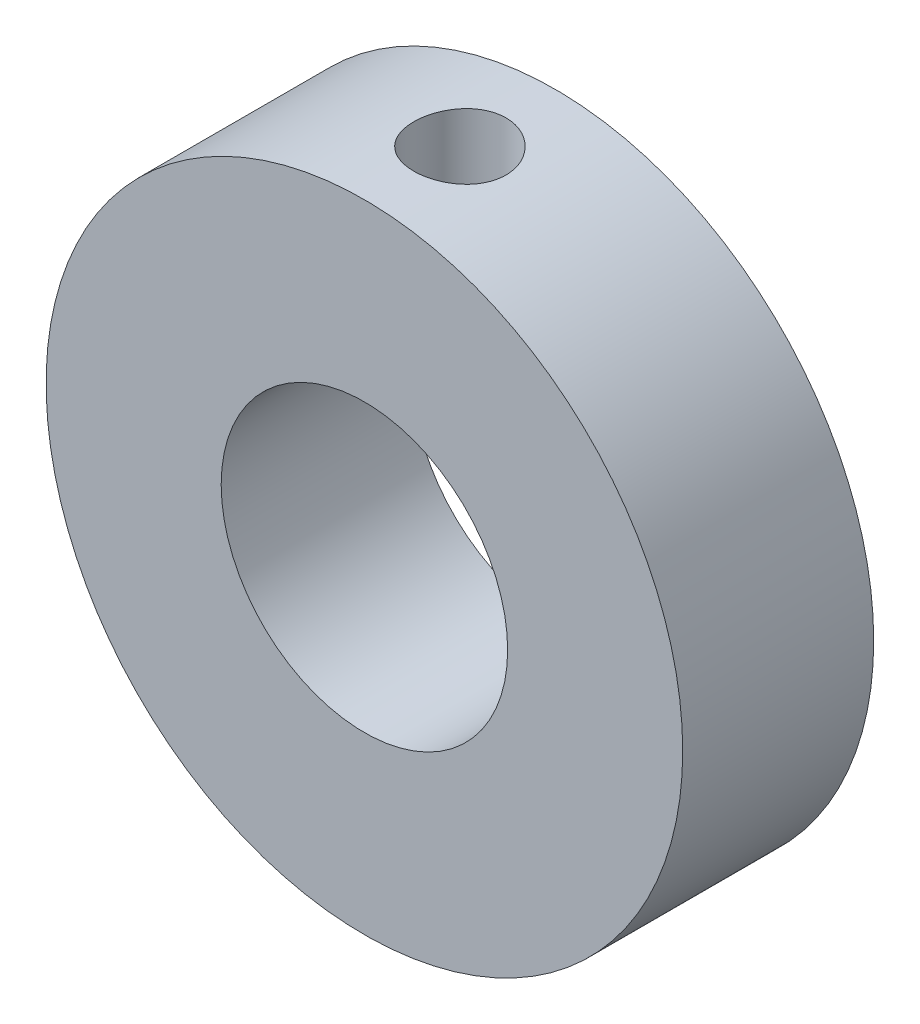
ISO-10303-21;
HEADER;
FILE_DESCRIPTION(('STEP AP214'),'2;1');
FILE_NAME('part.step','',(''),(''),'','','');
FILE_SCHEMA(('AUTOMOTIVE_DESIGN { 1 0 10303 214 1 1 1 1 }'));
ENDSEC;
DATA;
#1=APPLICATION_CONTEXT('core data for automotive mechanical design processes');
#2=APPLICATION_PROTOCOL_DEFINITION('international standard','automotive_design',2000,#1);
#3=PRODUCT_CONTEXT('',#1,'mechanical');
#4=PRODUCT('Part','Part','',(#3));
#5=PRODUCT_RELATED_PRODUCT_CATEGORY('part','',(#4));
#6=PRODUCT_DEFINITION_FORMATION('','',#4);
#7=PRODUCT_DEFINITION_CONTEXT('part definition',#1,'design');
#8=PRODUCT_DEFINITION('design','',#6,#7);
#9=PRODUCT_DEFINITION_SHAPE('','',#8);
#10=(LENGTH_UNIT() NAMED_UNIT(*) SI_UNIT(.MILLI.,.METRE.));
#11=(NAMED_UNIT(*) PLANE_ANGLE_UNIT() SI_UNIT($,.RADIAN.));
#12=(NAMED_UNIT(*) SI_UNIT($,.STERADIAN.) SOLID_ANGLE_UNIT());
#13=UNCERTAINTY_MEASURE_WITH_UNIT(LENGTH_MEASURE(1.E-05),#10,'distance_accuracy_value','');
#14=(GEOMETRIC_REPRESENTATION_CONTEXT(3) GLOBAL_UNCERTAINTY_ASSIGNED_CONTEXT((#13)) GLOBAL_UNIT_ASSIGNED_CONTEXT((#10,
#11,#12)) REPRESENTATION_CONTEXT('',''));
#15=CARTESIAN_POINT('',(0.,0.,0.));
#16=DIRECTION('',(0.,0.,1.));
#17=DIRECTION('',(1.,0.,0.));
#18=AXIS2_PLACEMENT_3D('',#15,#16,#17);
#19=CARTESIAN_POINT('',(0.,0.,5.99999999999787));
#20=DIRECTION('',(0.,0.,1.00000000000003));
#21=DIRECTION('',(1.,0.,0.));
#22=AXIS2_PLACEMENT_3D('',#19,#20,#21);
#23=PLANE('',#22);
#24=CARTESIAN_POINT('',(0.,0.,5.99999999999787));
#25=DIRECTION('',(0.,0.,1.00000000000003));
#26=DIRECTION('',(1.,0.,0.));
#27=AXIS2_PLACEMENT_3D('',#24,#25,#26);
#28=CIRCLE('',#27,10.);
#29=CARTESIAN_POINT('',(10.,0.,5.99999999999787));
#30=VERTEX_POINT('',#29);
#31=EDGE_CURVE('E11',#30,#30,#28,.T.);
#32=ORIENTED_EDGE('',*,*,#31,.T.);
#33=EDGE_LOOP('',(#32));
#34=FACE_BOUND('',#33,.T.);
#35=CARTESIAN_POINT('',(0.,0.,5.99999999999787));
#36=DIRECTION('',(0.,0.,1.00000000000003));
#37=DIRECTION('',(1.,0.,0.));
#38=AXIS2_PLACEMENT_3D('',#35,#36,#37);
#39=CIRCLE('',#38,4.5);
#40=CARTESIAN_POINT('',(4.5,0.,5.99999999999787));
#41=VERTEX_POINT('',#40);
#42=EDGE_CURVE('E55',#41,#41,#39,.T.);
#43=ORIENTED_EDGE('',*,*,#42,.F.);
#44=EDGE_LOOP('',(#43));
#45=FACE_BOUND('',#44,.T.);
#46=ADVANCED_FACE('F26',(#34,#45),#23,.T.);
#47=CARTESIAN_POINT('',(0.,0.,0.));
#48=DIRECTION('',(0.,0.,1.00000000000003));
#49=DIRECTION('',(1.,0.,0.));
#50=AXIS2_PLACEMENT_3D('',#47,#48,#49);
#51=PLANE('',#50);
#52=CARTESIAN_POINT('',(0.,0.,0.));
#53=DIRECTION('',(0.,0.,1.00000000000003));
#54=DIRECTION('',(1.,0.,0.));
#55=AXIS2_PLACEMENT_3D('',#52,#53,#54);
#56=CIRCLE('',#55,10.);
#57=CARTESIAN_POINT('',(10.,0.,0.));
#58=VERTEX_POINT('',#57);
#59=EDGE_CURVE('E40',#58,#58,#56,.T.);
#60=ORIENTED_EDGE('',*,*,#59,.F.);
#61=EDGE_LOOP('',(#60));
#62=FACE_BOUND('',#61,.T.);
#63=CARTESIAN_POINT('',(0.,0.,0.));
#64=DIRECTION('',(0.,0.,1.00000000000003));
#65=DIRECTION('',(1.,0.,0.));
#66=AXIS2_PLACEMENT_3D('',#63,#64,#65);
#67=CIRCLE('',#66,4.5);
#68=CARTESIAN_POINT('',(4.5,0.,0.));
#69=VERTEX_POINT('',#68);
#70=EDGE_CURVE('E53',#69,#69,#67,.T.);
#71=ORIENTED_EDGE('',*,*,#70,.T.);
#72=EDGE_LOOP('',(#71));
#73=FACE_BOUND('',#72,.T.);
#74=ADVANCED_FACE('F69',(#62,#73),#51,.F.);
#75=CARTESIAN_POINT('',(0.,0.,5.99999999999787));
#76=DIRECTION('',(0.,0.,-1.00000000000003));
#77=DIRECTION('',(-1.,0.,0.));
#78=AXIS2_PLACEMENT_3D('',#75,#76,#77);
#79=CYLINDRICAL_SURFACE('',#78,10.);
#80=CARTESIAN_POINT('',(0.,10.0000000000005,1.55));
#81=CARTESIAN_POINT('',(0.0809915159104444,9.99999873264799,1.55000336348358));
#82=CARTESIAN_POINT('',(0.162030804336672,9.99900572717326,1.55680872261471));
#83=CARTESIAN_POINT('',(0.321846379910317,9.99513998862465,1.58384469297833));
#84=CARTESIAN_POINT('',(0.400620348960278,9.99226539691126,1.60408857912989));
#85=CARTESIAN_POINT('',(0.553569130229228,9.98495969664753,1.6573858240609));
#86=CARTESIAN_POINT('',(0.627747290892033,9.98052973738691,1.69042972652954));
#87=CARTESIAN_POINT('',(0.769493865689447,9.97060349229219,1.76836639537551));
#88=CARTESIAN_POINT('',(0.837063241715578,9.96510736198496,1.81325743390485));
#89=CARTESIAN_POINT('',(0.964180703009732,9.95361550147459,1.91396441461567));
#90=CARTESIAN_POINT('',(1.02367340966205,9.94761673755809,1.96984991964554));
#91=CARTESIAN_POINT('',(1.1324711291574,9.93581960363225,2.09080979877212));
#92=CARTESIAN_POINT('',(1.18177557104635,9.93002124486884,2.15588468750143));
#93=CARTESIAN_POINT('',(1.26901088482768,9.91925193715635,2.29374571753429));
#94=CARTESIAN_POINT('',(1.30688852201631,9.91428490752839,2.36656587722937));
#95=CARTESIAN_POINT('',(1.3698548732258,9.90578181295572,2.51761836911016));
#96=CARTESIAN_POINT('',(1.39494423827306,9.90224567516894,2.59585042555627));
#97=CARTESIAN_POINT('',(1.43145060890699,9.89703441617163,2.75492503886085));
#98=CARTESIAN_POINT('',(1.44296217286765,9.8953464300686,2.83574546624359));
#99=CARTESIAN_POINT('',(1.45227903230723,9.89398348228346,2.99818718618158));
#100=CARTESIAN_POINT('',(1.45008506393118,9.89430841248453,3.07980843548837));
#101=CARTESIAN_POINT('',(1.4321304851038,9.89692281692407,3.24086883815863));
#102=CARTESIAN_POINT('',(1.41647493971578,9.89919707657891,3.32031998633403));
#103=CARTESIAN_POINT('',(1.37220596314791,9.9054301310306,3.47545562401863));
#104=CARTESIAN_POINT('',(1.34359218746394,9.90938897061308,3.55114001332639));
#105=CARTESIAN_POINT('',(1.27410893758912,9.91856202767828,3.69691483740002));
#106=CARTESIAN_POINT('',(1.23319471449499,9.92378081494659,3.76698364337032));
#107=CARTESIAN_POINT('',(1.14030387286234,9.934882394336,3.89930098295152));
#108=CARTESIAN_POINT('',(1.08832657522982,9.94076522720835,3.96154903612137));
#109=CARTESIAN_POINT('',(0.974207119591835,9.95259936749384,4.07706699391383));
#110=CARTESIAN_POINT('',(0.911974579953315,9.95855080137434,4.13024763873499));
#111=CARTESIAN_POINT('',(0.779419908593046,9.96980047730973,4.22542311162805));
#112=CARTESIAN_POINT('',(0.70909774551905,9.97509871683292,4.2674178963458));
#113=CARTESIAN_POINT('',(0.562284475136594,9.98445005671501,4.33903318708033));
#114=CARTESIAN_POINT('',(0.485790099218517,9.98850249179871,4.36864708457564));
#115=CARTESIAN_POINT('',(0.328842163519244,9.99489997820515,4.41458382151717));
#116=CARTESIAN_POINT('',(0.248388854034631,9.99724513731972,4.43090750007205));
#117=CARTESIAN_POINT('',(0.0865774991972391,9.99994961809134,4.4496823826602));
#118=CARTESIAN_POINT('',(0.00523398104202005,10.0003265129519,4.45225635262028));
#119=CARTESIAN_POINT('',(-0.156723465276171,9.99909975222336,4.44378420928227));
#120=CARTESIAN_POINT('',(-0.237337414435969,9.99749615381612,4.43273848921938));
#121=CARTESIAN_POINT('',(-0.395177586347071,9.99249946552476,4.39744258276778));
#122=CARTESIAN_POINT('',(-0.472417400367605,9.98911444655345,4.37325193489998));
#123=CARTESIAN_POINT('',(-0.621744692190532,9.98093335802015,4.31241545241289));
#124=CARTESIAN_POINT('',(-0.693831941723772,9.97613722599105,4.27576906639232));
#125=CARTESIAN_POINT('',(-0.831349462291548,9.96562352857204,4.1907714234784));
#126=CARTESIAN_POINT('',(-0.896730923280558,9.95989989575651,4.1423419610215));
#127=CARTESIAN_POINT('',(-1.01848194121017,9.94818790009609,4.03526215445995));
#128=CARTESIAN_POINT('',(-1.07485101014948,9.94219952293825,3.97661125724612));
#129=CARTESIAN_POINT('',(-1.17742146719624,9.93057755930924,3.85020812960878));
#130=CARTESIAN_POINT('',(-1.22354075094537,9.92494707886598,3.78238894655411));
#131=CARTESIAN_POINT('',(-1.30373253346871,9.91473259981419,3.63989433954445));
#132=CARTESIAN_POINT('',(-1.33780534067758,9.91014857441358,3.56521909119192));
#133=CARTESIAN_POINT('',(-1.39280849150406,9.90256825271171,3.41138122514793));
#134=CARTESIAN_POINT('',(-1.41378269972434,9.89956666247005,3.3322345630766));
#135=CARTESIAN_POINT('',(-1.44213326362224,9.89547675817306,3.17149553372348));
#136=CARTESIAN_POINT('',(-1.44951049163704,9.89438832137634,3.08990332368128));
#137=CARTESIAN_POINT('',(-1.45043794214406,9.89425233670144,2.92740729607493));
#138=CARTESIAN_POINT('',(-1.44411723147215,9.89518573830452,2.84650420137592));
#139=CARTESIAN_POINT('',(-1.41810410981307,9.89894695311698,2.6869242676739));
#140=CARTESIAN_POINT('',(-1.3984117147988,9.90177476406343,2.60824742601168));
#141=CARTESIAN_POINT('',(-1.34625875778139,9.9089996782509,2.45538512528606));
#142=CARTESIAN_POINT('',(-1.31380662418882,9.91339574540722,2.38119673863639));
#143=CARTESIAN_POINT('',(-1.23706815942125,9.92326319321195,2.23929688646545));
#144=CARTESIAN_POINT('',(-1.19278148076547,9.92873460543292,2.17158561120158));
#145=CARTESIAN_POINT('',(-1.09315992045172,9.94019772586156,2.04390537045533));
#146=CARTESIAN_POINT('',(-1.03772929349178,9.94619366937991,1.98401148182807));
#147=CARTESIAN_POINT('',(-0.917595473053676,9.95799445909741,1.8743291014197));
#148=CARTESIAN_POINT('',(-0.852890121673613,9.96379926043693,1.82454296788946));
#149=CARTESIAN_POINT('',(-0.715654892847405,9.97459753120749,1.73626316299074));
#150=CARTESIAN_POINT('',(-0.643086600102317,9.97958668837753,1.69782869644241));
#151=CARTESIAN_POINT('',(-0.49248801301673,9.98814904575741,1.63375036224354));
#152=CARTESIAN_POINT('',(-0.414463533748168,9.99172372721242,1.60809310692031));
#153=CARTESIAN_POINT('',(-0.280064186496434,9.99622850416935,1.57618749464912));
#154=CARTESIAN_POINT('',(-0.224523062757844,9.99763563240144,1.56638199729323));
#155=CARTESIAN_POINT('',(-0.112662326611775,9.99952181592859,1.55328711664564));
#156=CARTESIAN_POINT('',(-0.0563427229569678,10.0000008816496,1.54999766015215));
#157=CARTESIAN_POINT('',(0.,10.0000000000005,1.55));
#158=B_SPLINE_CURVE_WITH_KNOTS('',3,(#80,#81,#82,#83,#84,#85,#86,#87,#88,#89,#90,#91,#92,#93,
#94,#95,#96,#97,#98,#99,#100,#101,#102,#103,#104,#105,#106,#107,#108,#109,#110,#111,#112,#113,
#114,#115,#116,#117,#118,#119,#120,#121,#122,#123,#124,#125,#126,#127,#128,#129,#130,#131,#132,
#133,#134,#135,#136,#137,#138,#139,#140,#141,#142,#143,#144,#145,#146,#147,#148,#149,#150,#151,
#152,#153,#154,#155,#156,#157),.UNSPECIFIED.,.T.,.F.,(4,2,2,2,2,2,2,2,2,2,2,2,2,2,2,2,2,2,2,2,2,
2,2,2,2,2,2,2,2,2,2,2,2,2,2,2,2,2,4),(0.,0.242768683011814,0.485777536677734,0.728607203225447,
0.97140147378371,1.21578441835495,1.46018105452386,1.70569929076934,1.95120502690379,
2.19499072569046,2.43876333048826,2.68065042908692,2.92254395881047,3.16532836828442,
3.40812768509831,3.65319411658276,3.8982614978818,4.14345952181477,4.38864206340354,
4.63163175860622,4.87461443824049,5.1165056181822,5.35840750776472,5.60196095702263,
5.84552758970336,6.0909800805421,6.33642628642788,6.58104607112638,6.82565016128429,
7.06795953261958,7.31026861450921,7.55241790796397,7.79457431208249,8.03890773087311,
8.28329809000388,8.52894143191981,8.77432684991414,8.94321370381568,9.11209866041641),.UNSPECIFIED.);
#159=CARTESIAN_POINT('',(0.,10.0000000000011,4.44999999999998));
#160=VERTEX_POINT('',#159);
#161=CARTESIAN_POINT('',(0.,10.0000000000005,1.55));
#162=VERTEX_POINT('',#161);
#163=EDGE_CURVE('E48',#160,#162,#158,.T.);
#164=ORIENTED_EDGE('',*,*,#163,.T.);
#165=EDGE_CURVE('E46',#162,#160,#158,.T.);
#166=ORIENTED_EDGE('',*,*,#165,.T.);
#167=EDGE_LOOP('',(#164,#166));
#168=FACE_BOUND('',#167,.T.);
#169=ORIENTED_EDGE('',*,*,#31,.F.);
#170=EDGE_LOOP('',(#169));
#171=FACE_BOUND('',#170,.T.);
#172=ORIENTED_EDGE('',*,*,#59,.T.);
#173=EDGE_LOOP('',(#172));
#174=FACE_BOUND('',#173,.T.);
#175=ADVANCED_FACE('F28',(#168,#171,#174),#79,.T.);
#176=CARTESIAN_POINT('',(0.,0.,5.99999999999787));
#177=DIRECTION('',(0.,0.,-1.00000000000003));
#178=DIRECTION('',(-1.,0.,0.));
#179=AXIS2_PLACEMENT_3D('',#176,#177,#178);
#180=CYLINDRICAL_SURFACE('',#179,4.5);
#181=CARTESIAN_POINT('',(0.,4.50000000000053,1.55));
#182=CARTESIAN_POINT('',(0.0792641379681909,4.49999986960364,1.55000012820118));
#183=CARTESIAN_POINT('',(0.158530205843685,4.49788617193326,1.55652074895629));
#184=CARTESIAN_POINT('',(0.31473654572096,4.48966180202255,1.58235734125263));
#185=CARTESIAN_POINT('',(0.391676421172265,4.48355045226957,1.60167548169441));
#186=CARTESIAN_POINT('',(0.540955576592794,4.46799676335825,1.65238250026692));
#187=CARTESIAN_POINT('',(0.613302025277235,4.45855977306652,1.68375200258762));
#188=CARTESIAN_POINT('',(0.751707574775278,4.43732403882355,1.7575864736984));
#189=CARTESIAN_POINT('',(0.817765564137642,4.42552487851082,1.80005339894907));
#190=CARTESIAN_POINT('',(0.943873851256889,4.40038188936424,1.89633381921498));
#191=CARTESIAN_POINT('',(1.00369045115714,4.38700284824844,1.95044417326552));
#192=CARTESIAN_POINT('',(1.1135760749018,4.36040719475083,2.06784382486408));
#193=CARTESIAN_POINT('',(1.1636431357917,4.34719061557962,2.13113496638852));
#194=CARTESIAN_POINT('',(1.25390615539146,4.32203410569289,2.2671597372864));
#195=CARTESIAN_POINT('',(1.29380474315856,4.31013738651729,2.34009945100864));
#196=CARTESIAN_POINT('',(1.36067058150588,4.28949985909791,2.49209887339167));
#197=CARTESIAN_POINT('',(1.38764148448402,4.28075815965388,2.5711568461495));
#198=CARTESIAN_POINT('',(1.42702128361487,4.26778988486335,2.7305018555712));
#199=CARTESIAN_POINT('',(1.43986574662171,4.26342863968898,2.8106699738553));
#200=CARTESIAN_POINT('',(1.45198926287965,4.25931590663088,2.97213286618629));
#201=CARTESIAN_POINT('',(1.451272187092,4.2595631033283,3.05342731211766));
#202=CARTESIAN_POINT('',(1.43663250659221,4.26452084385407,3.21118159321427));
#203=CARTESIAN_POINT('',(1.42327026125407,4.26904198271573,3.28770039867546));
#204=CARTESIAN_POINT('',(1.38463065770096,4.28172947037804,3.43734610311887));
#205=CARTESIAN_POINT('',(1.3593519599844,4.28989622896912,3.51047261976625));
#206=CARTESIAN_POINT('',(1.29721469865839,4.30909520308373,3.65256436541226));
#207=CARTESIAN_POINT('',(1.26018476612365,4.32016937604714,3.72144874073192));
#208=CARTESIAN_POINT('',(1.17571515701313,4.34391693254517,3.8522067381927));
#209=CARTESIAN_POINT('',(1.1282726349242,4.35659075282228,3.91407843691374));
#210=CARTESIAN_POINT('',(1.02160169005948,4.38286269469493,4.03221405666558));
#211=CARTESIAN_POINT('',(0.961912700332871,4.39647580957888,4.08805957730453));
#212=CARTESIAN_POINT('',(0.833848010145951,4.42255154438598,4.18905339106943));
#213=CARTESIAN_POINT('',(0.765471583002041,4.43501406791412,4.23420078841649));
#214=CARTESIAN_POINT('',(0.62112950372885,4.45752987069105,4.31282451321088));
#215=CARTESIAN_POINT('',(0.545102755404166,4.4675611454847,4.34619540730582));
#216=CARTESIAN_POINT('',(0.388115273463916,4.48392499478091,4.3995475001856));
#217=CARTESIAN_POINT('',(0.307156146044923,4.49025876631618,4.41953303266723));
#218=CARTESIAN_POINT('',(0.146149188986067,4.49831872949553,4.44482129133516));
#219=CARTESIAN_POINT('',(0.066199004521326,4.50022240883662,4.45068994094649));
#220=CARTESIAN_POINT('',(-0.0935554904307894,4.49973601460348,4.44918102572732));
#221=CARTESIAN_POINT('',(-0.173359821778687,4.49734661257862,4.44180553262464));
#222=CARTESIAN_POINT('',(-0.328336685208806,4.48865943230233,4.41446913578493));
#223=CARTESIAN_POINT('',(-0.403576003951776,4.48246781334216,4.39484984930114));
#224=CARTESIAN_POINT('',(-0.54966990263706,4.46690770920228,4.34400433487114));
#225=CARTESIAN_POINT('',(-0.620523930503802,4.45753882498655,4.31277664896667));
#226=CARTESIAN_POINT('',(-0.757832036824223,4.43628701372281,4.23872069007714));
#227=CARTESIAN_POINT('',(-0.824129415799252,4.4243464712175,4.19561887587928));
#228=CARTESIAN_POINT('',(-0.948737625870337,4.39931163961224,4.09936314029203));
#229=CARTESIAN_POINT('',(-1.00704615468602,4.38621701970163,4.04620633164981));
#230=CARTESIAN_POINT('',(-1.11658436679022,4.35965053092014,3.92868716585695));
#231=CARTESIAN_POINT('',(-1.16741037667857,4.34618612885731,3.86394597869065));
#232=CARTESIAN_POINT('',(-1.25751933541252,4.32097695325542,3.72656208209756));
#233=CARTESIAN_POINT('',(-1.2968023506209,4.30923216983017,3.65391941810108));
#234=CARTESIAN_POINT('',(-1.3624915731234,4.28891622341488,3.50286747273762));
#235=CARTESIAN_POINT('',(-1.38893767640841,4.28033524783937,3.42447694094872));
#236=CARTESIAN_POINT('',(-1.42814836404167,4.26741452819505,3.26401869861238));
#237=CARTESIAN_POINT('',(-1.44091858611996,4.26307303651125,3.18195251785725));
#238=CARTESIAN_POINT('',(-1.45199374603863,4.25931269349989,3.02071427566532));
#239=CARTESIAN_POINT('',(-1.45096441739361,4.25966727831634,2.94159268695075));
#240=CARTESIAN_POINT('',(-1.43609121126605,4.26470424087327,2.78471077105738));
#241=CARTESIAN_POINT('',(-1.42224800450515,4.26938639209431,2.70695037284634));
#242=CARTESIAN_POINT('',(-1.38259771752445,4.2823877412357,2.55627146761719));
#243=CARTESIAN_POINT('',(-1.35699262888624,4.29064540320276,2.48329408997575));
#244=CARTESIAN_POINT('',(-1.29470640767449,4.30984831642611,2.3426138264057));
#245=CARTESIAN_POINT('',(-1.25802292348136,4.32079413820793,2.27491206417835));
#246=CARTESIAN_POINT('',(-1.17285424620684,4.34470290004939,2.14368154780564));
#247=CARTESIAN_POINT('',(-1.12394484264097,4.35773039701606,2.08043991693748));
#248=CARTESIAN_POINT('',(-1.01644559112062,4.384050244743,1.96284630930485));
#249=CARTESIAN_POINT('',(-0.957853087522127,4.39734266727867,1.90849677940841));
#250=CARTESIAN_POINT('',(-0.830150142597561,4.42326100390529,1.80829225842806));
#251=CARTESIAN_POINT('',(-0.760740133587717,4.43584649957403,1.76280736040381));
#252=CARTESIAN_POINT('',(-0.614855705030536,4.45840648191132,1.68420691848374));
#253=CARTESIAN_POINT('',(-0.538383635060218,4.46838183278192,1.65108727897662));
#254=CARTESIAN_POINT('',(-0.385774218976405,4.48404575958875,1.6001016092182));
#255=CARTESIAN_POINT('',(-0.309950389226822,4.48997456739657,1.58137033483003));
#256=CARTESIAN_POINT('',(-0.156084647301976,4.49795129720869,1.55632092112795));
#257=CARTESIAN_POINT('',(-0.0780432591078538,4.50000012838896,1.54999987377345));
#258=CARTESIAN_POINT('',(0.,4.50000000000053,1.55));
#259=B_SPLINE_CURVE_WITH_KNOTS('',3,(#181,#182,#183,#184,#185,#186,#187,#188,#189,#190,#191,
#192,#193,#194,#195,#196,#197,#198,#199,#200,#201,#202,#203,#204,#205,#206,#207,#208,#209,#210,
#211,#212,#213,#214,#215,#216,#217,#218,#219,#220,#221,#222,#223,#224,#225,#226,#227,#228,#229,
#230,#231,#232,#233,#234,#235,#236,#237,#238,#239,#240,#241,#242,#243,#244,#245,#246,#247,#248,
#249,#250,#251,#252,#253,#254,#255,#256,#257,#258),.UNSPECIFIED.,.T.,.F.,(4,2,2,2,2,2,2,2,2,2,2,
2,2,2,2,2,2,2,2,2,2,2,2,2,2,2,2,2,2,2,2,2,2,2,2,2,2,2,4),(0.,0.237505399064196,
0.475051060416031,0.712216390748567,0.94942356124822,1.19360399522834,1.4378335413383,
1.68854739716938,1.93919037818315,2.18186741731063,2.42447518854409,2.65681182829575,
2.88917459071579,3.12509496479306,3.36107989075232,3.60852807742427,3.85599697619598,
4.10562834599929,4.35517885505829,4.59454514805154,4.83387400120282,5.06680670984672,
5.29976868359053,5.53862540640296,5.77755082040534,6.02658093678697,6.27560962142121,
6.52385931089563,6.77200662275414,7.00822744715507,7.24443590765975,7.47673135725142,
7.70907615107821,7.95100011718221,8.19299054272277,8.44357246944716,8.69407132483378,
8.92797332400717,9.16182050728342),.UNSPECIFIED.);
#260=CARTESIAN_POINT('',(0.,4.50000000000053,1.55));
#261=VERTEX_POINT('',#260);
#262=EDGE_CURVE('E31',#261,#261,#259,.T.);
#263=ORIENTED_EDGE('',*,*,#262,.F.);
#264=EDGE_LOOP('',(#263));
#265=FACE_BOUND('',#264,.T.);
#266=ORIENTED_EDGE('',*,*,#42,.T.);
#267=EDGE_LOOP('',(#266));
#268=FACE_BOUND('',#267,.T.);
#269=ORIENTED_EDGE('',*,*,#70,.F.);
#270=EDGE_LOOP('',(#269));
#271=FACE_BOUND('',#270,.T.);
#272=ADVANCED_FACE('F62',(#265,#268,#271),#180,.F.);
#273=CARTESIAN_POINT('',(0.,0.,3.));
#274=DIRECTION('',(0.,-1.00000000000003,0.));
#275=DIRECTION('',(0.,0.,-1.00000000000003));
#276=AXIS2_PLACEMENT_3D('',#273,#274,#275);
#277=CYLINDRICAL_SURFACE('',#276,1.44999999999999);
#278=ORIENTED_EDGE('',*,*,#262,.T.);
#279=EDGE_LOOP('',(#278));
#280=FACE_BOUND('',#279,.T.);
#281=ORIENTED_EDGE('',*,*,#163,.F.);
#282=ORIENTED_EDGE('',*,*,#165,.F.);
#283=EDGE_LOOP('',(#281,#282));
#284=FACE_BOUND('',#283,.T.);
#285=ADVANCED_FACE('F49',(#280,#284),#277,.F.);
#286=CLOSED_SHELL('',(#46,#74,#175,#272,#285));
#287=MANIFOLD_SOLID_BREP('B2',#286);
#288=ADVANCED_BREP_SHAPE_REPRESENTATION('',(#18,#287),#14);
#289=SHAPE_DEFINITION_REPRESENTATION(#9,#288);
ENDSEC;
END-ISO-10303-21;
